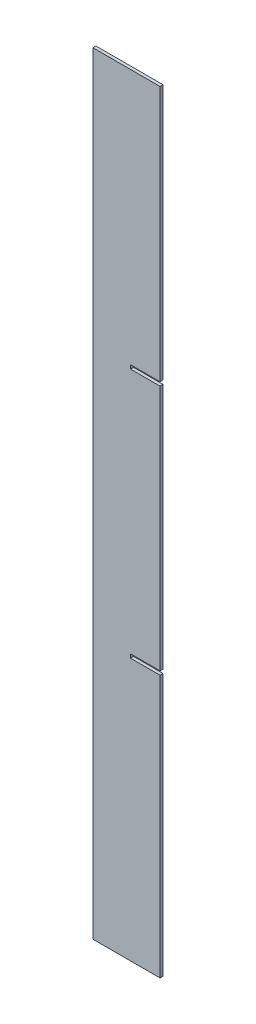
ISO-10303-21;
HEADER;
FILE_DESCRIPTION(('STEP AP214'),'2;1');
FILE_NAME('part.step','',(''),(''),'','','');
FILE_SCHEMA(('AUTOMOTIVE_DESIGN { 1 0 10303 214 1 1 1 1 }'));
ENDSEC;
DATA;
#1=APPLICATION_CONTEXT('core data for automotive mechanical design processes');
#2=APPLICATION_PROTOCOL_DEFINITION('international standard','automotive_design',2000,#1);
#3=PRODUCT_CONTEXT('',#1,'mechanical');
#4=PRODUCT('Part','Part','',(#3));
#5=PRODUCT_RELATED_PRODUCT_CATEGORY('part','',(#4));
#6=PRODUCT_DEFINITION_FORMATION('','',#4);
#7=PRODUCT_DEFINITION_CONTEXT('part definition',#1,'design');
#8=PRODUCT_DEFINITION('design','',#6,#7);
#9=PRODUCT_DEFINITION_SHAPE('','',#8);
#10=(LENGTH_UNIT() NAMED_UNIT(*) SI_UNIT(.MILLI.,.METRE.));
#11=(NAMED_UNIT(*) PLANE_ANGLE_UNIT() SI_UNIT($,.RADIAN.));
#12=(NAMED_UNIT(*) SI_UNIT($,.STERADIAN.) SOLID_ANGLE_UNIT());
#13=UNCERTAINTY_MEASURE_WITH_UNIT(LENGTH_MEASURE(1.E-05),#10,'distance_accuracy_value','');
#14=(GEOMETRIC_REPRESENTATION_CONTEXT(3) GLOBAL_UNCERTAINTY_ASSIGNED_CONTEXT((#13)) GLOBAL_UNIT_ASSIGNED_CONTEXT((#10,
#11,#12)) REPRESENTATION_CONTEXT('',''));
#15=CARTESIAN_POINT('',(0.,0.,0.));
#16=DIRECTION('',(0.,0.,1.));
#17=DIRECTION('',(1.,0.,0.));
#18=AXIS2_PLACEMENT_3D('',#15,#16,#17);
#19=CARTESIAN_POINT('',(-4475.8372,583.037,2.));
#20=DIRECTION('',(-1.,0.,0.));
#21=DIRECTION('',(0.,0.,1.));
#22=AXIS2_PLACEMENT_3D('',#19,#20,#21);
#23=PLANE('',#22);
#24=DIRECTION('',(0.,1.,0.));
#25=VECTOR('',#24,1.);
#26=CARTESIAN_POINT('',(-4475.8372,583.037,0.));
#27=LINE('',#26,#25);
#28=CARTESIAN_POINT('',(-4475.8372,580.7869,0.));
#29=VERTEX_POINT('',#28);
#30=CARTESIAN_POINT('',(-4475.8372,583.2869,0.));
#31=VERTEX_POINT('',#30);
#32=EDGE_CURVE('E103',#29,#31,#27,.T.);
#33=ORIENTED_EDGE('',*,*,#32,.T.);
#34=DIRECTION('',(0.,0.,-1.));
#35=VECTOR('',#34,1.);
#36=CARTESIAN_POINT('',(-4475.8372,583.2869,2.));
#37=LINE('',#36,#35);
#38=CARTESIAN_POINT('',(-4475.8372,583.2869,2.));
#39=VERTEX_POINT('',#38);
#40=EDGE_CURVE('E11',#39,#31,#37,.T.);
#41=ORIENTED_EDGE('',*,*,#40,.F.);
#42=DIRECTION('',(0.,1.,0.));
#43=VECTOR('',#42,1.);
#44=CARTESIAN_POINT('',(-4475.8372,580.7869,2.));
#45=LINE('',#44,#43);
#46=CARTESIAN_POINT('',(-4475.8372,580.7869,2.));
#47=VERTEX_POINT('',#46);
#48=EDGE_CURVE('E109',#47,#39,#45,.T.);
#49=ORIENTED_EDGE('',*,*,#48,.F.);
#50=DIRECTION('',(0.,0.,-1.));
#51=VECTOR('',#50,1.);
#52=CARTESIAN_POINT('',(-4475.8372,580.7869,2.));
#53=LINE('',#52,#51);
#54=EDGE_CURVE('E155',#47,#29,#53,.T.);
#55=ORIENTED_EDGE('',*,*,#54,.T.);
#56=EDGE_LOOP('',(#33,#41,#49,#55));
#57=FACE_BOUND('',#56,.T.);
#58=ADVANCED_FACE('F39',(#57),#23,.F.);
#59=CARTESIAN_POINT('',(-4475.8372,583.2869,2.));
#60=DIRECTION('',(0.,1.,0.));
#61=DIRECTION('',(0.,0.,1.));
#62=AXIS2_PLACEMENT_3D('',#59,#60,#61);
#63=PLANE('',#62);
#64=DIRECTION('',(1.,0.,0.));
#65=VECTOR('',#64,1.);
#66=CARTESIAN_POINT('',(-4475.8372,583.2869,0.));
#67=LINE('',#66,#65);
#68=CARTESIAN_POINT('',(-4456.129,583.2869,0.));
#69=VERTEX_POINT('',#68);
#70=EDGE_CURVE('E160',#31,#69,#67,.T.);
#71=ORIENTED_EDGE('',*,*,#70,.T.);
#72=DIRECTION('',(0.,0.,-1.));
#73=VECTOR('',#72,1.);
#74=CARTESIAN_POINT('',(-4456.129,583.2869,2.));
#75=LINE('',#74,#73);
#76=CARTESIAN_POINT('',(-4456.129,583.2869,2.));
#77=VERTEX_POINT('',#76);
#78=EDGE_CURVE('E47',#77,#69,#75,.T.);
#79=ORIENTED_EDGE('',*,*,#78,.F.);
#80=DIRECTION('',(1.,0.,0.));
#81=VECTOR('',#80,1.);
#82=CARTESIAN_POINT('',(-4475.8372,583.2869,2.));
#83=LINE('',#82,#81);
#84=EDGE_CURVE('E248',#39,#77,#83,.T.);
#85=ORIENTED_EDGE('',*,*,#84,.F.);
#86=ORIENTED_EDGE('',*,*,#40,.T.);
#87=EDGE_LOOP('',(#71,#79,#85,#86));
#88=FACE_BOUND('',#87,.T.);
#89=ADVANCED_FACE('F251',(#88),#63,.F.);
#90=CARTESIAN_POINT('',(-4456.129,583.2869,2.));
#91=DIRECTION('',(-1.,0.,0.));
#92=DIRECTION('',(0.,0.,1.));
#93=AXIS2_PLACEMENT_3D('',#90,#91,#92);
#94=PLANE('',#93);
#95=DIRECTION('',(0.,1.,0.));
#96=VECTOR('',#95,1.);
#97=CARTESIAN_POINT('',(-4456.129,583.2869,0.));
#98=LINE('',#97,#96);
#99=CARTESIAN_POINT('',(-4456.129,753.8775,0.));
#100=VERTEX_POINT('',#99);
#101=EDGE_CURVE('E162',#69,#100,#98,.T.);
#102=ORIENTED_EDGE('',*,*,#101,.T.);
#103=DIRECTION('',(0.,0.,-1.));
#104=VECTOR('',#103,1.);
#105=CARTESIAN_POINT('',(-4456.129,753.8775,2.));
#106=LINE('',#105,#104);
#107=CARTESIAN_POINT('',(-4456.129,753.8775,2.));
#108=VERTEX_POINT('',#107);
#109=EDGE_CURVE('E200',#108,#100,#106,.T.);
#110=ORIENTED_EDGE('',*,*,#109,.F.);
#111=DIRECTION('',(0.,1.,0.));
#112=VECTOR('',#111,1.);
#113=CARTESIAN_POINT('',(-4456.129,583.2869,2.));
#114=LINE('',#113,#112);
#115=EDGE_CURVE('E209',#77,#108,#114,.T.);
#116=ORIENTED_EDGE('',*,*,#115,.F.);
#117=ORIENTED_EDGE('',*,*,#78,.T.);
#118=EDGE_LOOP('',(#102,#110,#116,#117));
#119=FACE_BOUND('',#118,.T.);
#120=ADVANCED_FACE('F207',(#119),#94,.F.);
#121=CARTESIAN_POINT('',(-4456.129,753.8775,2.));
#122=DIRECTION('',(0.,-1.,0.));
#123=DIRECTION('',(0.,0.,-1.));
#124=AXIS2_PLACEMENT_3D('',#121,#122,#123);
#125=PLANE('',#124);
#126=DIRECTION('',(-1.,0.,0.));
#127=VECTOR('',#126,1.);
#128=CARTESIAN_POINT('',(-4456.129,753.8775,0.));
#129=LINE('',#128,#127);
#130=CARTESIAN_POINT('',(-4500.8945,753.8775,0.));
#131=VERTEX_POINT('',#130);
#132=EDGE_CURVE('E164',#100,#131,#129,.T.);
#133=ORIENTED_EDGE('',*,*,#132,.T.);
#134=DIRECTION('',(0.,0.,-1.));
#135=VECTOR('',#134,1.);
#136=CARTESIAN_POINT('',(-4500.8945,753.8775,2.));
#137=LINE('',#136,#135);
#138=CARTESIAN_POINT('',(-4500.8945,753.8775,2.));
#139=VERTEX_POINT('',#138);
#140=EDGE_CURVE('E197',#139,#131,#137,.T.);
#141=ORIENTED_EDGE('',*,*,#140,.F.);
#142=DIRECTION('',(-1.,0.,0.));
#143=VECTOR('',#142,1.);
#144=CARTESIAN_POINT('',(-4456.129,753.8775,2.));
#145=LINE('',#144,#143);
#146=EDGE_CURVE('E227',#108,#139,#145,.T.);
#147=ORIENTED_EDGE('',*,*,#146,.F.);
#148=ORIENTED_EDGE('',*,*,#109,.T.);
#149=EDGE_LOOP('',(#133,#141,#147,#148));
#150=FACE_BOUND('',#149,.T.);
#151=ADVANCED_FACE('F218',(#150),#125,.F.);
#152=CARTESIAN_POINT('',(-4500.8945,753.8775,2.));
#153=DIRECTION('',(0.999999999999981,-1.9417475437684E-07,0.));
#154=DIRECTION('',(1.9417475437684E-07,0.999999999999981,0.));
#155=AXIS2_PLACEMENT_3D('',#152,#153,#154);
#156=PLANE('',#155);
#157=DIRECTION('',(-1.9417475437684E-07,-0.999999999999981,0.));
#158=VECTOR('',#157,1.);
#159=CARTESIAN_POINT('',(-4500.8945,753.8775,0.));
#160=LINE('',#159,#158);
#161=CARTESIAN_POINT('',(-4500.8946,238.8775,0.));
#162=VERTEX_POINT('',#161);
#163=EDGE_CURVE('E166',#131,#162,#160,.T.);
#164=ORIENTED_EDGE('',*,*,#163,.T.);
#165=DIRECTION('',(0.,0.,-1.));
#166=VECTOR('',#165,1.);
#167=CARTESIAN_POINT('',(-4500.8946,238.8775,2.));
#168=LINE('',#167,#166);
#169=CARTESIAN_POINT('',(-4500.8946,238.8775,2.));
#170=VERTEX_POINT('',#169);
#171=EDGE_CURVE('E194',#170,#162,#168,.T.);
#172=ORIENTED_EDGE('',*,*,#171,.F.);
#173=DIRECTION('',(-1.9417475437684E-07,-0.999999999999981,0.));
#174=VECTOR('',#173,1.);
#175=CARTESIAN_POINT('',(-4500.8945,753.8775,2.));
#176=LINE('',#175,#174);
#177=EDGE_CURVE('E224',#139,#170,#176,.T.);
#178=ORIENTED_EDGE('',*,*,#177,.F.);
#179=ORIENTED_EDGE('',*,*,#140,.T.);
#180=EDGE_LOOP('',(#164,#172,#178,#179));
#181=FACE_BOUND('',#180,.T.);
#182=ADVANCED_FACE('F222',(#181),#156,.F.);
#183=CARTESIAN_POINT('',(-4500.8946,238.8775,2.));
#184=DIRECTION('',(0.,1.,0.));
#185=DIRECTION('',(0.,0.,1.));
#186=AXIS2_PLACEMENT_3D('',#183,#184,#185);
#187=PLANE('',#186);
#188=DIRECTION('',(1.,0.,0.));
#189=VECTOR('',#188,1.);
#190=CARTESIAN_POINT('',(-4500.8946,238.8775,0.));
#191=LINE('',#190,#189);
#192=CARTESIAN_POINT('',(-4456.1291,238.8775,0.));
#193=VERTEX_POINT('',#192);
#194=EDGE_CURVE('E168',#162,#193,#191,.T.);
#195=ORIENTED_EDGE('',*,*,#194,.T.);
#196=DIRECTION('',(0.,0.,-1.));
#197=VECTOR('',#196,1.);
#198=CARTESIAN_POINT('',(-4456.1291,238.8775,2.));
#199=LINE('',#198,#197);
#200=CARTESIAN_POINT('',(-4456.1291,238.8775,2.));
#201=VERTEX_POINT('',#200);
#202=EDGE_CURVE('E191',#201,#193,#199,.T.);
#203=ORIENTED_EDGE('',*,*,#202,.F.);
#204=DIRECTION('',(1.,0.,0.));
#205=VECTOR('',#204,1.);
#206=CARTESIAN_POINT('',(-4500.8946,238.8775,2.));
#207=LINE('',#206,#205);
#208=EDGE_CURVE('E226',#170,#201,#207,.T.);
#209=ORIENTED_EDGE('',*,*,#208,.F.);
#210=ORIENTED_EDGE('',*,*,#171,.T.);
#211=EDGE_LOOP('',(#195,#203,#209,#210));
#212=FACE_BOUND('',#211,.T.);
#213=ADVANCED_FACE('F263',(#212),#187,.F.);
#214=CARTESIAN_POINT('',(-4456.1291,238.8775,2.));
#215=DIRECTION('',(-0.999999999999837,5.71724236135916E-07,0.));
#216=DIRECTION('',(-5.71724236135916E-07,-0.999999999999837,0.));
#217=AXIS2_PLACEMENT_3D('',#214,#215,#216);
#218=PLANE('',#217);
#219=DIRECTION('',(5.71724236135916E-07,0.999999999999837,0.));
#220=VECTOR('',#219,1.);
#221=CARTESIAN_POINT('',(-4456.1291,238.8775,0.));
#222=LINE('',#221,#220);
#223=CARTESIAN_POINT('',(-4456.129,413.787,0.));
#224=VERTEX_POINT('',#223);
#225=EDGE_CURVE('E170',#193,#224,#222,.T.);
#226=ORIENTED_EDGE('',*,*,#225,.T.);
#227=DIRECTION('',(0.,0.,-1.));
#228=VECTOR('',#227,1.);
#229=CARTESIAN_POINT('',(-4456.129,413.787,2.));
#230=LINE('',#229,#228);
#231=CARTESIAN_POINT('',(-4456.129,413.787,2.));
#232=VERTEX_POINT('',#231);
#233=EDGE_CURVE('E188',#232,#224,#230,.T.);
#234=ORIENTED_EDGE('',*,*,#233,.F.);
#235=DIRECTION('',(5.71724236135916E-07,0.999999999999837,0.));
#236=VECTOR('',#235,1.);
#237=CARTESIAN_POINT('',(-4456.1291,238.8775,2.));
#238=LINE('',#237,#236);
#239=EDGE_CURVE('E229',#201,#232,#238,.T.);
#240=ORIENTED_EDGE('',*,*,#239,.F.);
#241=ORIENTED_EDGE('',*,*,#202,.T.);
#242=EDGE_LOOP('',(#226,#234,#240,#241));
#243=FACE_BOUND('',#242,.T.);
#244=ADVANCED_FACE('F266',(#243),#218,.F.);
#245=CARTESIAN_POINT('',(-4456.129,413.787,2.));
#246=DIRECTION('',(0.,-1.,0.));
#247=DIRECTION('',(0.,0.,-1.));
#248=AXIS2_PLACEMENT_3D('',#245,#246,#247);
#249=PLANE('',#248);
#250=DIRECTION('',(-1.,0.,0.));
#251=VECTOR('',#250,1.);
#252=CARTESIAN_POINT('',(-4456.129,413.787,0.));
#253=LINE('',#252,#251);
#254=CARTESIAN_POINT('',(-4475.8372,413.787,0.));
#255=VERTEX_POINT('',#254);
#256=EDGE_CURVE('E172',#224,#255,#253,.T.);
#257=ORIENTED_EDGE('',*,*,#256,.T.);
#258=DIRECTION('',(0.,0.,-1.));
#259=VECTOR('',#258,1.);
#260=CARTESIAN_POINT('',(-4475.8372,413.787,2.));
#261=LINE('',#260,#259);
#262=CARTESIAN_POINT('',(-4475.8372,413.787,2.));
#263=VERTEX_POINT('',#262);
#264=EDGE_CURVE('E185',#263,#255,#261,.T.);
#265=ORIENTED_EDGE('',*,*,#264,.F.);
#266=DIRECTION('',(-1.,0.,0.));
#267=VECTOR('',#266,1.);
#268=CARTESIAN_POINT('',(-4456.129,413.787,2.));
#269=LINE('',#268,#267);
#270=EDGE_CURVE('E235',#232,#263,#269,.T.);
#271=ORIENTED_EDGE('',*,*,#270,.F.);
#272=ORIENTED_EDGE('',*,*,#233,.T.);
#273=EDGE_LOOP('',(#257,#265,#271,#272));
#274=FACE_BOUND('',#273,.T.);
#275=ADVANCED_FACE('F241',(#274),#249,.F.);
#276=CARTESIAN_POINT('',(-4475.8372,416.0371,2.));
#277=DIRECTION('',(-1.,0.,0.));
#278=DIRECTION('',(0.,0.,1.));
#279=AXIS2_PLACEMENT_3D('',#276,#277,#278);
#280=PLANE('',#279);
#281=DIRECTION('',(0.,1.,0.));
#282=VECTOR('',#281,1.);
#283=CARTESIAN_POINT('',(-4475.8372,416.0371,0.));
#284=LINE('',#283,#282);
#285=CARTESIAN_POINT('',(-4475.8372,416.287,0.));
#286=VERTEX_POINT('',#285);
#287=EDGE_CURVE('E175',#255,#286,#284,.T.);
#288=ORIENTED_EDGE('',*,*,#287,.T.);
#289=DIRECTION('',(0.,0.,-1.));
#290=VECTOR('',#289,1.);
#291=CARTESIAN_POINT('',(-4475.8372,416.287,2.));
#292=LINE('',#291,#290);
#293=CARTESIAN_POINT('',(-4475.8372,416.287,2.));
#294=VERTEX_POINT('',#293);
#295=EDGE_CURVE('E150',#294,#286,#292,.T.);
#296=ORIENTED_EDGE('',*,*,#295,.F.);
#297=DIRECTION('',(0.,1.,0.));
#298=VECTOR('',#297,1.);
#299=CARTESIAN_POINT('',(-4475.8372,413.787,2.));
#300=LINE('',#299,#298);
#301=EDGE_CURVE('E141',#263,#294,#300,.T.);
#302=ORIENTED_EDGE('',*,*,#301,.F.);
#303=ORIENTED_EDGE('',*,*,#264,.T.);
#304=EDGE_LOOP('',(#288,#296,#302,#303));
#305=FACE_BOUND('',#304,.T.);
#306=ADVANCED_FACE('F244',(#305),#280,.F.);
#307=CARTESIAN_POINT('',(-4475.8372,416.287,2.));
#308=DIRECTION('',(0.,1.,0.));
#309=DIRECTION('',(0.,0.,1.));
#310=AXIS2_PLACEMENT_3D('',#307,#308,#309);
#311=PLANE('',#310);
#312=DIRECTION('',(1.,0.,0.));
#313=VECTOR('',#312,1.);
#314=CARTESIAN_POINT('',(-4475.8372,416.287,0.));
#315=LINE('',#314,#313);
#316=CARTESIAN_POINT('',(-4456.129,416.287,0.));
#317=VERTEX_POINT('',#316);
#318=EDGE_CURVE('E149',#286,#317,#315,.T.);
#319=ORIENTED_EDGE('',*,*,#318,.T.);
#320=DIRECTION('',(0.,0.,-1.));
#321=VECTOR('',#320,1.);
#322=CARTESIAN_POINT('',(-4456.129,416.287,2.));
#323=LINE('',#322,#321);
#324=CARTESIAN_POINT('',(-4456.129,416.287,2.));
#325=VERTEX_POINT('',#324);
#326=EDGE_CURVE('E146',#325,#317,#323,.T.);
#327=ORIENTED_EDGE('',*,*,#326,.F.);
#328=DIRECTION('',(1.,0.,0.));
#329=VECTOR('',#328,1.);
#330=CARTESIAN_POINT('',(-4475.8372,416.287,2.));
#331=LINE('',#330,#329);
#332=EDGE_CURVE('E135',#294,#325,#331,.T.);
#333=ORIENTED_EDGE('',*,*,#332,.F.);
#334=ORIENTED_EDGE('',*,*,#295,.T.);
#335=EDGE_LOOP('',(#319,#327,#333,#334));
#336=FACE_BOUND('',#335,.T.);
#337=ADVANCED_FACE('F147',(#336),#311,.F.);
#338=CARTESIAN_POINT('',(-4456.129,416.287,2.));
#339=DIRECTION('',(-1.,0.,0.));
#340=DIRECTION('',(0.,0.,1.));
#341=AXIS2_PLACEMENT_3D('',#338,#339,#340);
#342=PLANE('',#341);
#343=DIRECTION('',(0.,1.,0.));
#344=VECTOR('',#343,1.);
#345=CARTESIAN_POINT('',(-4456.129,416.287,0.));
#346=LINE('',#345,#344);
#347=CARTESIAN_POINT('',(-4456.129,580.7869,0.));
#348=VERTEX_POINT('',#347);
#349=EDGE_CURVE('E96',#317,#348,#346,.T.);
#350=ORIENTED_EDGE('',*,*,#349,.T.);
#351=DIRECTION('',(0.,0.,-1.));
#352=VECTOR('',#351,1.);
#353=CARTESIAN_POINT('',(-4456.129,580.7869,2.));
#354=LINE('',#353,#352);
#355=CARTESIAN_POINT('',(-4456.129,580.7869,2.));
#356=VERTEX_POINT('',#355);
#357=EDGE_CURVE('E151',#356,#348,#354,.T.);
#358=ORIENTED_EDGE('',*,*,#357,.F.);
#359=DIRECTION('',(0.,1.,0.));
#360=VECTOR('',#359,1.);
#361=CARTESIAN_POINT('',(-4456.129,416.287,2.));
#362=LINE('',#361,#360);
#363=EDGE_CURVE('E139',#325,#356,#362,.T.);
#364=ORIENTED_EDGE('',*,*,#363,.F.);
#365=ORIENTED_EDGE('',*,*,#326,.T.);
#366=EDGE_LOOP('',(#350,#358,#364,#365));
#367=FACE_BOUND('',#366,.T.);
#368=ADVANCED_FACE('F153',(#367),#342,.F.);
#369=CARTESIAN_POINT('',(-4456.129,580.7869,2.));
#370=DIRECTION('',(0.,-1.,0.));
#371=DIRECTION('',(0.,0.,-1.));
#372=AXIS2_PLACEMENT_3D('',#369,#370,#371);
#373=PLANE('',#372);
#374=DIRECTION('',(-1.,0.,0.));
#375=VECTOR('',#374,1.);
#376=CARTESIAN_POINT('',(-4456.129,580.7869,0.));
#377=LINE('',#376,#375);
#378=EDGE_CURVE('E179',#348,#29,#377,.T.);
#379=ORIENTED_EDGE('',*,*,#378,.T.);
#380=ORIENTED_EDGE('',*,*,#54,.F.);
#381=DIRECTION('',(-1.,0.,0.));
#382=VECTOR('',#381,1.);
#383=CARTESIAN_POINT('',(-4456.129,580.7869,2.));
#384=LINE('',#383,#382);
#385=EDGE_CURVE('E55',#356,#47,#384,.T.);
#386=ORIENTED_EDGE('',*,*,#385,.F.);
#387=ORIENTED_EDGE('',*,*,#357,.T.);
#388=EDGE_LOOP('',(#379,#380,#386,#387));
#389=FACE_BOUND('',#388,.T.);
#390=ADVANCED_FACE('F246',(#389),#373,.F.);
#391=CARTESIAN_POINT('',(0.,0.,2.));
#392=DIRECTION('',(0.,0.,-1.));
#393=DIRECTION('',(-1.,0.,0.));
#394=AXIS2_PLACEMENT_3D('',#391,#392,#393);
#395=PLANE('',#394);
#396=ORIENTED_EDGE('',*,*,#48,.T.);
#397=ORIENTED_EDGE('',*,*,#84,.T.);
#398=ORIENTED_EDGE('',*,*,#115,.T.);
#399=ORIENTED_EDGE('',*,*,#146,.T.);
#400=ORIENTED_EDGE('',*,*,#177,.T.);
#401=ORIENTED_EDGE('',*,*,#208,.T.);
#402=ORIENTED_EDGE('',*,*,#239,.T.);
#403=ORIENTED_EDGE('',*,*,#270,.T.);
#404=ORIENTED_EDGE('',*,*,#301,.T.);
#405=ORIENTED_EDGE('',*,*,#332,.T.);
#406=ORIENTED_EDGE('',*,*,#363,.T.);
#407=ORIENTED_EDGE('',*,*,#385,.T.);
#408=EDGE_LOOP('',(#396,#397,#398,#399,#400,#401,#402,#403,#404,#405,#406,#407));
#409=FACE_BOUND('',#408,.T.);
#410=ADVANCED_FACE('F137',(#409),#395,.F.);
#411=CARTESIAN_POINT('',(0.,0.,0.));
#412=DIRECTION('',(0.,0.,-1.));
#413=DIRECTION('',(-1.,0.,0.));
#414=AXIS2_PLACEMENT_3D('',#411,#412,#413);
#415=PLANE('',#414);
#416=ORIENTED_EDGE('',*,*,#32,.F.);
#417=ORIENTED_EDGE('',*,*,#378,.F.);
#418=ORIENTED_EDGE('',*,*,#349,.F.);
#419=ORIENTED_EDGE('',*,*,#318,.F.);
#420=ORIENTED_EDGE('',*,*,#287,.F.);
#421=ORIENTED_EDGE('',*,*,#256,.F.);
#422=ORIENTED_EDGE('',*,*,#225,.F.);
#423=ORIENTED_EDGE('',*,*,#194,.F.);
#424=ORIENTED_EDGE('',*,*,#163,.F.);
#425=ORIENTED_EDGE('',*,*,#132,.F.);
#426=ORIENTED_EDGE('',*,*,#101,.F.);
#427=ORIENTED_EDGE('',*,*,#70,.F.);
#428=EDGE_LOOP('',(#416,#417,#418,#419,#420,#421,#422,#423,#424,#425,#426,#427));
#429=FACE_BOUND('',#428,.T.);
#430=ADVANCED_FACE('F213',(#429),#415,.T.);
#431=CLOSED_SHELL('',(#58,#89,#120,#151,#182,#213,#244,#275,#306,#337,#368,#390,#410,#430));
#432=MANIFOLD_SOLID_BREP('B2',#431);
#433=ADVANCED_BREP_SHAPE_REPRESENTATION('',(#18,#432),#14);
#434=SHAPE_DEFINITION_REPRESENTATION(#9,#433);
ENDSEC;
END-ISO-10303-21;
